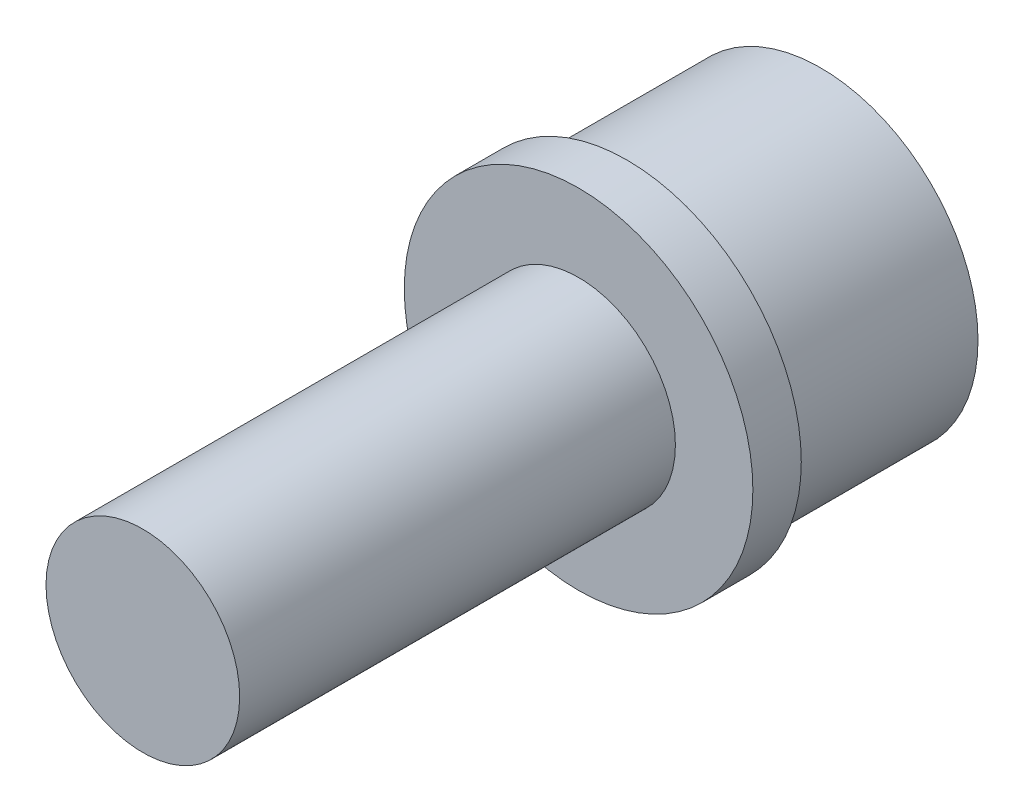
ISO-10303-21;
HEADER;
FILE_DESCRIPTION(('STEP AP214'),'2;1');
FILE_NAME('part.step','',(''),(''),'','','');
FILE_SCHEMA(('AUTOMOTIVE_DESIGN { 1 0 10303 214 1 1 1 1 }'));
ENDSEC;
DATA;
#1=APPLICATION_CONTEXT('core data for automotive mechanical design processes');
#2=APPLICATION_PROTOCOL_DEFINITION('international standard','automotive_design',2000,#1);
#3=PRODUCT_CONTEXT('',#1,'mechanical');
#4=PRODUCT('Part','Part','',(#3));
#5=PRODUCT_RELATED_PRODUCT_CATEGORY('part','',(#4));
#6=PRODUCT_DEFINITION_FORMATION('','',#4);
#7=PRODUCT_DEFINITION_CONTEXT('part definition',#1,'design');
#8=PRODUCT_DEFINITION('design','',#6,#7);
#9=PRODUCT_DEFINITION_SHAPE('','',#8);
#10=(LENGTH_UNIT() NAMED_UNIT(*) SI_UNIT(.MILLI.,.METRE.));
#11=(NAMED_UNIT(*) PLANE_ANGLE_UNIT() SI_UNIT($,.RADIAN.));
#12=(NAMED_UNIT(*) SI_UNIT($,.STERADIAN.) SOLID_ANGLE_UNIT());
#13=UNCERTAINTY_MEASURE_WITH_UNIT(LENGTH_MEASURE(1.E-05),#10,'distance_accuracy_value','');
#14=(GEOMETRIC_REPRESENTATION_CONTEXT(3) GLOBAL_UNCERTAINTY_ASSIGNED_CONTEXT((#13)) GLOBAL_UNIT_ASSIGNED_CONTEXT((#10,
#11,#12)) REPRESENTATION_CONTEXT('',''));
#15=CARTESIAN_POINT('',(0.,0.,0.));
#16=DIRECTION('',(0.,0.,1.));
#17=DIRECTION('',(1.,0.,0.));
#18=AXIS2_PLACEMENT_3D('',#15,#16,#17);
#19=CARTESIAN_POINT('',(-2.66913643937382,5.37361244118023,-12.32));
#20=DIRECTION('',(0.,0.,1.));
#21=DIRECTION('',(0.0625443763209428,0.998042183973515,0.));
#22=AXIS2_PLACEMENT_3D('',#19,#20,#21);
#23=PLANE('',#22);
#24=DIRECTION('',(-0.895602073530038,-0.44485607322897,0.));
#25=VECTOR('',#24,1.);
#26=CARTESIAN_POINT('',(2.88579651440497,-1.91629289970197,-12.32));
#27=LINE('',#26,#25);
#28=CARTESIAN_POINT('',(2.88579651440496,-1.91629289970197,-12.32));
#29=VERTEX_POINT('',#28);
#30=CARTESIAN_POINT('',(-0.216660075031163,-3.45731954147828,-12.32));
#31=VERTEX_POINT('',#30);
#32=EDGE_CURVE('E90',#29,#31,#27,.T.);
#33=ORIENTED_EDGE('',*,*,#32,.T.);
#34=DIRECTION('',(0.833057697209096,-0.553186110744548,0.));
#35=VECTOR('',#34,1.);
#36=CARTESIAN_POINT('',(-3.10245658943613,-1.5410266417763,-12.32));
#37=LINE('',#36,#35);
#38=CARTESIAN_POINT('',(-3.10245658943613,-1.5410266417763,-12.32));
#39=VERTEX_POINT('',#38);
#40=EDGE_CURVE('E315',#39,#31,#37,.T.);
#41=ORIENTED_EDGE('',*,*,#40,.F.);
#42=DIRECTION('',(-0.0625443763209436,-0.998042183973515,0.));
#43=VECTOR('',#42,1.);
#44=CARTESIAN_POINT('',(-2.88579651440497,1.91629289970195,-12.32));
#45=LINE('',#44,#43);
#46=CARTESIAN_POINT('',(-2.88579651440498,1.91629289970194,-12.32));
#47=VERTEX_POINT('',#46);
#48=EDGE_CURVE('E309',#47,#39,#45,.T.);
#49=ORIENTED_EDGE('',*,*,#48,.F.);
#50=DIRECTION('',(0.895602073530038,0.44485607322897,0.));
#51=VECTOR('',#50,1.);
#52=CARTESIAN_POINT('',(-2.88579651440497,1.91629289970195,-12.32));
#53=LINE('',#52,#51);
#54=CARTESIAN_POINT('',(0.216660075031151,3.45731954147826,-12.32));
#55=VERTEX_POINT('',#54);
#56=EDGE_CURVE('E72',#47,#55,#53,.T.);
#57=ORIENTED_EDGE('',*,*,#56,.T.);
#58=DIRECTION('',(-0.833057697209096,0.553186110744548,0.));
#59=VECTOR('',#58,1.);
#60=CARTESIAN_POINT('',(3.10245658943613,1.54102664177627,-12.32));
#61=LINE('',#60,#59);
#62=CARTESIAN_POINT('',(3.10245658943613,1.54102664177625,-12.32));
#63=VERTEX_POINT('',#62);
#64=EDGE_CURVE('E69',#63,#55,#61,.T.);
#65=ORIENTED_EDGE('',*,*,#64,.F.);
#66=DIRECTION('',(-0.0625443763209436,-0.998042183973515,0.));
#67=VECTOR('',#66,1.);
#68=CARTESIAN_POINT('',(3.10245658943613,1.54102664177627,-12.32));
#69=LINE('',#68,#67);
#70=EDGE_CURVE('E66',#63,#29,#69,.T.);
#71=ORIENTED_EDGE('',*,*,#70,.T.);
#72=EDGE_LOOP('',(#33,#41,#49,#57,#65,#71));
#73=FACE_BOUND('',#72,.T.);
#74=ADVANCED_FACE('F16',(#73),#23,.F.);
#75=CARTESIAN_POINT('',(3.10245658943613,1.54102664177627,-12.32));
#76=DIRECTION('',(-0.553186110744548,-0.833057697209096,0.));
#77=DIRECTION('',(-0.833057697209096,0.553186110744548,0.));
#78=AXIS2_PLACEMENT_3D('',#75,#76,#77);
#79=PLANE('',#78);
#80=DIRECTION('',(0.833057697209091,-0.553186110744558,0.));
#81=VECTOR('',#80,1.);
#82=CARTESIAN_POINT('',(0.216660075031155,3.45731954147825,-18.));
#83=LINE('',#82,#81);
#84=CARTESIAN_POINT('',(0.216660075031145,3.45731954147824,-18.));
#85=VERTEX_POINT('',#84);
#86=CARTESIAN_POINT('',(3.10245658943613,1.54102664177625,-18.));
#87=VERTEX_POINT('',#86);
#88=EDGE_CURVE('E81',#85,#87,#83,.T.);
#89=ORIENTED_EDGE('',*,*,#88,.T.);
#90=DIRECTION('',(0.,0.,-1.));
#91=VECTOR('',#90,1.);
#92=CARTESIAN_POINT('',(3.10245658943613,1.54102664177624,-12.32));
#93=LINE('',#92,#91);
#94=EDGE_CURVE('E75',#87,#63,#93,.F.);
#95=ORIENTED_EDGE('',*,*,#94,.T.);
#96=ORIENTED_EDGE('',*,*,#64,.T.);
#97=DIRECTION('',(0.,0.,-1.));
#98=VECTOR('',#97,1.);
#99=CARTESIAN_POINT('',(0.216660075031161,3.45731954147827,-12.32));
#100=LINE('',#99,#98);
#101=EDGE_CURVE('E302',#55,#85,#100,.T.);
#102=ORIENTED_EDGE('',*,*,#101,.T.);
#103=EDGE_LOOP('',(#89,#95,#96,#102));
#104=FACE_BOUND('',#103,.T.);
#105=ADVANCED_FACE('F79',(#104),#79,.T.);
#106=CARTESIAN_POINT('',(3.10245658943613,1.54102664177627,-12.32));
#107=DIRECTION('',(0.998042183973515,-0.0625443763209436,0.));
#108=DIRECTION('',(-0.0625443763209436,-0.998042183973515,0.));
#109=AXIS2_PLACEMENT_3D('',#106,#107,#108);
#110=PLANE('',#109);
#111=ORIENTED_EDGE('',*,*,#70,.F.);
#112=ORIENTED_EDGE('',*,*,#94,.F.);
#113=DIRECTION('',(0.0625443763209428,0.998042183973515,0.));
#114=VECTOR('',#113,1.);
#115=CARTESIAN_POINT('',(2.99412655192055,-0.187633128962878,-18.));
#116=LINE('',#115,#114);
#117=CARTESIAN_POINT('',(2.88579651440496,-1.91629289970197,-18.));
#118=VERTEX_POINT('',#117);
#119=EDGE_CURVE('E299',#87,#118,#116,.F.);
#120=ORIENTED_EDGE('',*,*,#119,.T.);
#121=DIRECTION('',(0.,0.,-1.));
#122=VECTOR('',#121,1.);
#123=CARTESIAN_POINT('',(2.88579651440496,-1.91629289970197,-12.32));
#124=LINE('',#123,#122);
#125=EDGE_CURVE('E87',#118,#29,#124,.F.);
#126=ORIENTED_EDGE('',*,*,#125,.T.);
#127=EDGE_LOOP('',(#111,#112,#120,#126));
#128=FACE_BOUND('',#127,.T.);
#129=ADVANCED_FACE('F85',(#128),#110,.F.);
#130=CARTESIAN_POINT('',(2.88579651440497,-1.91629289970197,-12.32));
#131=DIRECTION('',(0.44485607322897,-0.895602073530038,0.));
#132=DIRECTION('',(-0.895602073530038,-0.44485607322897,0.));
#133=AXIS2_PLACEMENT_3D('',#130,#131,#132);
#134=PLANE('',#133);
#135=ORIENTED_EDGE('',*,*,#32,.F.);
#136=ORIENTED_EDGE('',*,*,#125,.F.);
#137=DIRECTION('',(-0.895602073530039,-0.444856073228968,0.));
#138=VECTOR('',#137,1.);
#139=CARTESIAN_POINT('',(2.88579651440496,-1.91629289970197,-18.));
#140=LINE('',#139,#138);
#141=CARTESIAN_POINT('',(-0.216660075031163,-3.45731954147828,-18.));
#142=VERTEX_POINT('',#141);
#143=EDGE_CURVE('E297',#118,#142,#140,.T.);
#144=ORIENTED_EDGE('',*,*,#143,.T.);
#145=DIRECTION('',(0.,0.,-1.));
#146=VECTOR('',#145,1.);
#147=CARTESIAN_POINT('',(-0.216660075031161,-3.45731954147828,-12.32));
#148=LINE('',#147,#146);
#149=EDGE_CURVE('E312',#31,#142,#148,.T.);
#150=ORIENTED_EDGE('',*,*,#149,.F.);
#151=EDGE_LOOP('',(#135,#136,#144,#150));
#152=FACE_BOUND('',#151,.T.);
#153=ADVANCED_FACE('F143',(#152),#134,.F.);
#154=CARTESIAN_POINT('',(-3.10245658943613,-1.5410266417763,-12.32));
#155=DIRECTION('',(0.553186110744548,0.833057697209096,0.));
#156=DIRECTION('',(0.833057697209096,-0.553186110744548,0.));
#157=AXIS2_PLACEMENT_3D('',#154,#155,#156);
#158=PLANE('',#157);
#159=DIRECTION('',(-0.833057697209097,0.553186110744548,0.));
#160=VECTOR('',#159,1.);
#161=CARTESIAN_POINT('',(-0.216660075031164,-3.45731954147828,-18.));
#162=LINE('',#161,#160);
#163=CARTESIAN_POINT('',(-3.10245658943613,-1.54102664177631,-18.));
#164=VERTEX_POINT('',#163);
#165=EDGE_CURVE('E295',#142,#164,#162,.T.);
#166=ORIENTED_EDGE('',*,*,#165,.T.);
#167=DIRECTION('',(0.,0.,-1.));
#168=VECTOR('',#167,1.);
#169=CARTESIAN_POINT('',(-3.10245658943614,-1.54102664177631,-12.32));
#170=LINE('',#169,#168);
#171=EDGE_CURVE('E307',#39,#164,#170,.T.);
#172=ORIENTED_EDGE('',*,*,#171,.F.);
#173=ORIENTED_EDGE('',*,*,#40,.T.);
#174=ORIENTED_EDGE('',*,*,#149,.T.);
#175=EDGE_LOOP('',(#166,#172,#173,#174));
#176=FACE_BOUND('',#175,.T.);
#177=ADVANCED_FACE('F140',(#176),#158,.T.);
#178=CARTESIAN_POINT('',(-2.88579651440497,1.91629289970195,-12.32));
#179=DIRECTION('',(0.998042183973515,-0.0625443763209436,0.));
#180=DIRECTION('',(-0.0625443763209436,-0.998042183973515,0.));
#181=AXIS2_PLACEMENT_3D('',#178,#179,#180);
#182=PLANE('',#181);
#183=DIRECTION('',(0.0625443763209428,0.998042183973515,0.));
#184=VECTOR('',#183,1.);
#185=CARTESIAN_POINT('',(-2.99412655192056,0.18763312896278,-18.));
#186=LINE('',#185,#184);
#187=CARTESIAN_POINT('',(-2.88579651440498,1.91629289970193,-18.));
#188=VERTEX_POINT('',#187);
#189=EDGE_CURVE('E33',#164,#188,#186,.T.);
#190=ORIENTED_EDGE('',*,*,#189,.T.);
#191=DIRECTION('',(0.,0.,-1.));
#192=VECTOR('',#191,1.);
#193=CARTESIAN_POINT('',(-2.88579651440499,1.91629289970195,-12.32));
#194=LINE('',#193,#192);
#195=EDGE_CURVE('E305',#188,#47,#194,.F.);
#196=ORIENTED_EDGE('',*,*,#195,.T.);
#197=ORIENTED_EDGE('',*,*,#48,.T.);
#198=ORIENTED_EDGE('',*,*,#171,.T.);
#199=EDGE_LOOP('',(#190,#196,#197,#198));
#200=FACE_BOUND('',#199,.T.);
#201=ADVANCED_FACE('F136',(#200),#182,.T.);
#202=CARTESIAN_POINT('',(-2.88579651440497,1.91629289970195,-12.32));
#203=DIRECTION('',(-0.44485607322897,0.895602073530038,0.));
#204=DIRECTION('',(0.895602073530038,0.44485607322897,0.));
#205=AXIS2_PLACEMENT_3D('',#202,#203,#204);
#206=PLANE('',#205);
#207=ORIENTED_EDGE('',*,*,#56,.F.);
#208=ORIENTED_EDGE('',*,*,#195,.F.);
#209=DIRECTION('',(0.895602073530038,0.444856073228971,0.));
#210=VECTOR('',#209,1.);
#211=CARTESIAN_POINT('',(-2.88579651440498,1.91629289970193,-18.));
#212=LINE('',#211,#210);
#213=EDGE_CURVE('E96',#188,#85,#212,.T.);
#214=ORIENTED_EDGE('',*,*,#213,.T.);
#215=ORIENTED_EDGE('',*,*,#101,.F.);
#216=EDGE_LOOP('',(#207,#208,#214,#215));
#217=FACE_BOUND('',#216,.T.);
#218=ADVANCED_FACE('F128',(#217),#206,.F.);
#219=CARTESIAN_POINT('',(-6.08805732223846,0.381520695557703,-18.));
#220=DIRECTION('',(0.,0.,1.));
#221=DIRECTION('',(0.0625443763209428,0.998042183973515,0.));
#222=AXIS2_PLACEMENT_3D('',#219,#220,#221);
#223=PLANE('',#222);
#224=CARTESIAN_POINT('',(0.,0.,-18.));
#225=DIRECTION('',(0.,0.,1.));
#226=DIRECTION('',(0.0625443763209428,0.998042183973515,0.));
#227=AXIS2_PLACEMENT_3D('',#224,#225,#226);
#228=CIRCLE('',#227,6.5);
#229=CARTESIAN_POINT('',(0.406538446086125,6.48727419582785,-18.));
#230=VERTEX_POINT('',#229);
#231=EDGE_CURVE('E94',#230,#230,#228,.T.);
#232=ORIENTED_EDGE('',*,*,#231,.F.);
#233=EDGE_LOOP('',(#232));
#234=FACE_BOUND('',#233,.T.);
#235=ORIENTED_EDGE('',*,*,#189,.F.);
#236=ORIENTED_EDGE('',*,*,#165,.F.);
#237=ORIENTED_EDGE('',*,*,#143,.F.);
#238=ORIENTED_EDGE('',*,*,#119,.F.);
#239=ORIENTED_EDGE('',*,*,#88,.F.);
#240=ORIENTED_EDGE('',*,*,#213,.F.);
#241=EDGE_LOOP('',(#235,#236,#237,#238,#239,#240));
#242=FACE_BOUND('',#241,.T.);
#243=ADVANCED_FACE('F118',(#234,#242),#223,.F.);
#244=CARTESIAN_POINT('',(0.,0.,-10.));
#245=DIRECTION('',(0.,0.,-1.));
#246=DIRECTION('',(-0.0625443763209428,-0.998042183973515,0.));
#247=AXIS2_PLACEMENT_3D('',#244,#245,#246);
#248=CYLINDRICAL_SURFACE('',#247,6.5);
#249=ORIENTED_EDGE('',*,*,#231,.T.);
#250=EDGE_LOOP('',(#249));
#251=FACE_BOUND('',#250,.T.);
#252=CARTESIAN_POINT('',(0.,0.,-10.));
#253=DIRECTION('',(0.,0.,1.));
#254=DIRECTION('',(1.,0.,0.));
#255=AXIS2_PLACEMENT_3D('',#252,#253,#254);
#256=CIRCLE('',#255,6.5);
#257=CARTESIAN_POINT('',(6.5,0.,-10.));
#258=VERTEX_POINT('',#257);
#259=EDGE_CURVE('E76',#258,#258,#256,.F.);
#260=ORIENTED_EDGE('',*,*,#259,.T.);
#261=EDGE_LOOP('',(#260));
#262=FACE_BOUND('',#261,.T.);
#263=ADVANCED_FACE('F115',(#251,#262),#248,.T.);
#264=CARTESIAN_POINT('',(0.,0.,-8.));
#265=DIRECTION('',(0.,0.,1.));
#266=DIRECTION('',(1.,0.,0.));
#267=AXIS2_PLACEMENT_3D('',#264,#265,#266);
#268=PLANE('',#267);
#269=CARTESIAN_POINT('',(0.,0.,-8.));
#270=DIRECTION('',(0.,0.,1.));
#271=DIRECTION('',(1.,0.,0.));
#272=AXIS2_PLACEMENT_3D('',#269,#270,#271);
#273=CIRCLE('',#272,7.2);
#274=CARTESIAN_POINT('',(7.2,0.,-8.));
#275=VERTEX_POINT('',#274);
#276=EDGE_CURVE('E286',#275,#275,#273,.T.);
#277=ORIENTED_EDGE('',*,*,#276,.T.);
#278=EDGE_LOOP('',(#277));
#279=FACE_BOUND('',#278,.T.);
#280=CARTESIAN_POINT('',(0.,0.,-8.));
#281=DIRECTION('',(0.,0.,1.));
#282=DIRECTION('',(1.,0.,0.));
#283=AXIS2_PLACEMENT_3D('',#280,#281,#282);
#284=CIRCLE('',#283,4.);
#285=CARTESIAN_POINT('',(4.,0.,-8.));
#286=VERTEX_POINT('',#285);
#287=EDGE_CURVE('E10',#286,#286,#284,.F.);
#288=ORIENTED_EDGE('',*,*,#287,.T.);
#289=EDGE_LOOP('',(#288));
#290=FACE_BOUND('',#289,.T.);
#291=ADVANCED_FACE('F117',(#279,#290),#268,.T.);
#292=CARTESIAN_POINT('',(0.,0.,-10.));
#293=DIRECTION('',(0.,0.,1.));
#294=DIRECTION('',(1.,0.,0.));
#295=AXIS2_PLACEMENT_3D('',#292,#293,#294);
#296=PLANE('',#295);
#297=ORIENTED_EDGE('',*,*,#259,.F.);
#298=EDGE_LOOP('',(#297));
#299=FACE_BOUND('',#298,.T.);
#300=CARTESIAN_POINT('',(0.,0.,-10.));
#301=DIRECTION('',(0.,0.,1.));
#302=DIRECTION('',(1.,0.,0.));
#303=AXIS2_PLACEMENT_3D('',#300,#301,#302);
#304=CIRCLE('',#303,7.2);
#305=CARTESIAN_POINT('',(7.2,0.,-10.));
#306=VERTEX_POINT('',#305);
#307=EDGE_CURVE('E284',#306,#306,#304,.T.);
#308=ORIENTED_EDGE('',*,*,#307,.F.);
#309=EDGE_LOOP('',(#308));
#310=FACE_BOUND('',#309,.T.);
#311=ADVANCED_FACE('F111',(#299,#310),#296,.F.);
#312=CARTESIAN_POINT('',(0.,0.,-8.));
#313=DIRECTION('',(0.,0.,-1.));
#314=DIRECTION('',(-1.,0.,0.));
#315=AXIS2_PLACEMENT_3D('',#312,#313,#314);
#316=CYLINDRICAL_SURFACE('',#315,7.2);
#317=ORIENTED_EDGE('',*,*,#276,.F.);
#318=EDGE_LOOP('',(#317));
#319=FACE_BOUND('',#318,.T.);
#320=ORIENTED_EDGE('',*,*,#307,.T.);
#321=EDGE_LOOP('',(#320));
#322=FACE_BOUND('',#321,.T.);
#323=ADVANCED_FACE('F103',(#319,#322),#316,.T.);
#324=CARTESIAN_POINT('',(-1.10915087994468E-13,0.,10.));
#325=DIRECTION('',(0.,0.,-1.));
#326=DIRECTION('',(-0.0625443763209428,-0.998042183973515,0.));
#327=AXIS2_PLACEMENT_3D('',#324,#325,#326);
#328=PLANE('',#327);
#329=CARTESIAN_POINT('',(0.,0.,10.));
#330=DIRECTION('',(0.,0.,-1.));
#331=DIRECTION('',(-0.0625443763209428,-0.998042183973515,0.));
#332=AXIS2_PLACEMENT_3D('',#329,#330,#331);
#333=CIRCLE('',#332,4.);
#334=CARTESIAN_POINT('',(-0.250177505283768,-3.99216873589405,10.));
#335=VERTEX_POINT('',#334);
#336=EDGE_CURVE('E25',#335,#335,#333,.T.);
#337=ORIENTED_EDGE('',*,*,#336,.F.);
#338=EDGE_LOOP('',(#337));
#339=FACE_BOUND('',#338,.T.);
#340=ADVANCED_FACE('F101',(#339),#328,.F.);
#341=CARTESIAN_POINT('',(0.,0.,-10.));
#342=DIRECTION('',(0.,0.,-1.));
#343=DIRECTION('',(-0.0625443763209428,-0.998042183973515,0.));
#344=AXIS2_PLACEMENT_3D('',#341,#342,#343);
#345=CYLINDRICAL_SURFACE('',#344,4.);
#346=ORIENTED_EDGE('',*,*,#287,.F.);
#347=EDGE_LOOP('',(#346));
#348=FACE_BOUND('',#347,.T.);
#349=ORIENTED_EDGE('',*,*,#336,.T.);
#350=EDGE_LOOP('',(#349));
#351=FACE_BOUND('',#350,.T.);
#352=ADVANCED_FACE('F18',(#348,#351),#345,.T.);
#353=CLOSED_SHELL('',(#74,#105,#129,#153,#177,#201,#218,#243,#263,#291,#311,#323,#340,#352));
#354=MANIFOLD_SOLID_BREP('B1',#353);
#355=ADVANCED_BREP_SHAPE_REPRESENTATION('',(#18,#354),#14);
#356=SHAPE_DEFINITION_REPRESENTATION(#9,#355);
ENDSEC;
END-ISO-10303-21;
